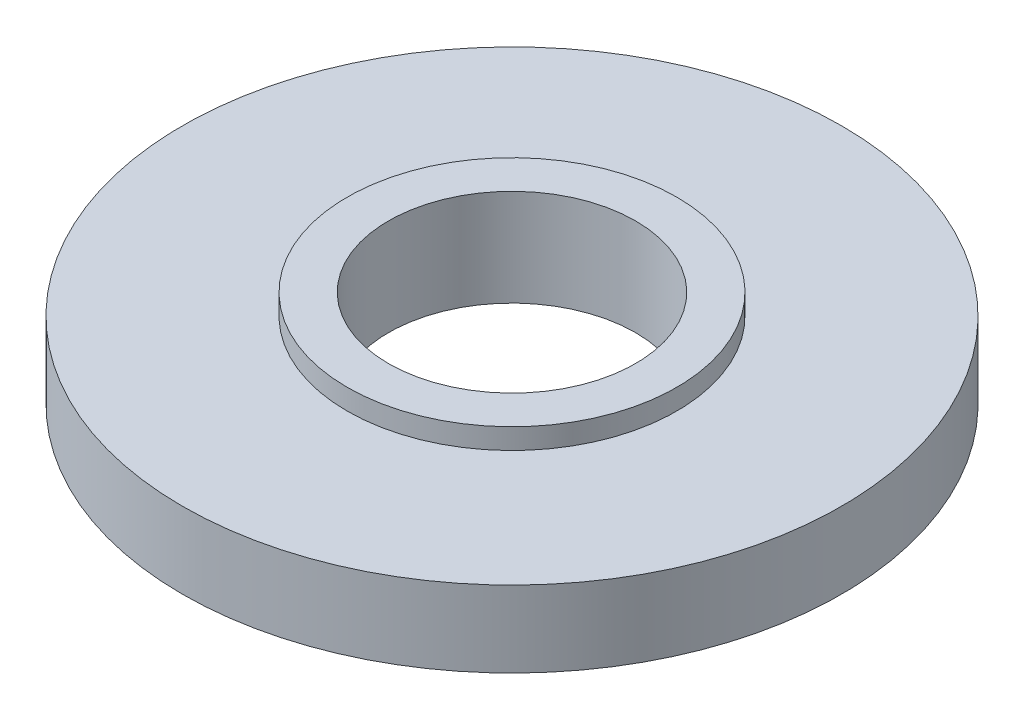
ISO-10303-21;
HEADER;
FILE_DESCRIPTION(('STEP AP214'),'2;1');
FILE_NAME('part.step','',(''),(''),'','','');
FILE_SCHEMA(('AUTOMOTIVE_DESIGN { 1 0 10303 214 1 1 1 1 }'));
ENDSEC;
DATA;
#1=APPLICATION_CONTEXT('core data for automotive mechanical design processes');
#2=APPLICATION_PROTOCOL_DEFINITION('international standard','automotive_design',2000,#1);
#3=PRODUCT_CONTEXT('',#1,'mechanical');
#4=PRODUCT('Part','Part','',(#3));
#5=PRODUCT_RELATED_PRODUCT_CATEGORY('part','',(#4));
#6=PRODUCT_DEFINITION_FORMATION('','',#4);
#7=PRODUCT_DEFINITION_CONTEXT('part definition',#1,'design');
#8=PRODUCT_DEFINITION('design','',#6,#7);
#9=PRODUCT_DEFINITION_SHAPE('','',#8);
#10=(LENGTH_UNIT() NAMED_UNIT(*) SI_UNIT(.MILLI.,.METRE.));
#11=(NAMED_UNIT(*) PLANE_ANGLE_UNIT() SI_UNIT($,.RADIAN.));
#12=(NAMED_UNIT(*) SI_UNIT($,.STERADIAN.) SOLID_ANGLE_UNIT());
#13=UNCERTAINTY_MEASURE_WITH_UNIT(LENGTH_MEASURE(1.E-05),#10,'distance_accuracy_value','');
#14=(GEOMETRIC_REPRESENTATION_CONTEXT(3) GLOBAL_UNCERTAINTY_ASSIGNED_CONTEXT((#13)) GLOBAL_UNIT_ASSIGNED_CONTEXT((#10,
#11,#12)) REPRESENTATION_CONTEXT('',''));
#15=CARTESIAN_POINT('',(0.,0.,0.));
#16=DIRECTION('',(0.,0.,1.));
#17=DIRECTION('',(1.,0.,0.));
#18=AXIS2_PLACEMENT_3D('',#15,#16,#17);
#19=CARTESIAN_POINT('',(0.,2.4675,0.));
#20=DIRECTION('',(0.,-1.,0.));
#21=DIRECTION('',(0.,0.,-1.));
#22=AXIS2_PLACEMENT_3D('',#19,#20,#21);
#23=CYLINDRICAL_SURFACE('',#22,4.);
#24=CARTESIAN_POINT('',(0.,1.85,0.));
#25=DIRECTION('',(0.,-1.,0.));
#26=DIRECTION('',(0.,0.,-1.));
#27=AXIS2_PLACEMENT_3D('',#24,#25,#26);
#28=CIRCLE('',#27,4.);
#29=CARTESIAN_POINT('',(0.,1.85,-4.));
#30=VERTEX_POINT('',#29);
#31=EDGE_CURVE('E17',#30,#30,#28,.F.);
#32=ORIENTED_EDGE('',*,*,#31,.T.);
#33=EDGE_LOOP('',(#32));
#34=FACE_BOUND('',#33,.T.);
#35=CARTESIAN_POINT('',(0.,2.35,0.));
#36=DIRECTION('',(0.,-1.,0.));
#37=DIRECTION('',(0.,0.,-1.));
#38=AXIS2_PLACEMENT_3D('',#35,#36,#37);
#39=CIRCLE('',#38,4.);
#40=CARTESIAN_POINT('',(0.,2.35,-4.));
#41=VERTEX_POINT('',#40);
#42=EDGE_CURVE('E33',#41,#41,#39,.T.);
#43=ORIENTED_EDGE('',*,*,#42,.T.);
#44=EDGE_LOOP('',(#43));
#45=FACE_BOUND('',#44,.T.);
#46=ADVANCED_FACE('F14',(#34,#45),#23,.T.);
#47=CARTESIAN_POINT('',(0.,1.85,0.));
#48=DIRECTION('',(0.,-1.,0.));
#49=DIRECTION('',(0.,0.,-1.));
#50=AXIS2_PLACEMENT_3D('',#47,#48,#49);
#51=PLANE('',#50);
#52=ORIENTED_EDGE('',*,*,#31,.F.);
#53=EDGE_LOOP('',(#52));
#54=FACE_BOUND('',#53,.T.);
#55=CARTESIAN_POINT('',(0.,1.85,0.));
#56=DIRECTION('',(0.,-1.,0.));
#57=DIRECTION('',(0.,0.,-1.));
#58=AXIS2_PLACEMENT_3D('',#55,#56,#57);
#59=CIRCLE('',#58,8.);
#60=CARTESIAN_POINT('',(0.,1.85,-8.));
#61=VERTEX_POINT('',#60);
#62=EDGE_CURVE('E31',#61,#61,#59,.T.);
#63=ORIENTED_EDGE('',*,*,#62,.F.);
#64=EDGE_LOOP('',(#63));
#65=FACE_BOUND('',#64,.T.);
#66=ADVANCED_FACE('F41',(#54,#65),#51,.F.);
#67=CARTESIAN_POINT('',(0.,2.35,0.));
#68=DIRECTION('',(0.,-1.,0.));
#69=DIRECTION('',(0.,0.,-1.));
#70=AXIS2_PLACEMENT_3D('',#67,#68,#69);
#71=PLANE('',#70);
#72=CARTESIAN_POINT('',(0.,2.35,0.));
#73=DIRECTION('',(0.,-1.,0.));
#74=DIRECTION('',(0.,0.,-1.));
#75=AXIS2_PLACEMENT_3D('',#72,#73,#74);
#76=CIRCLE('',#75,3.);
#77=CARTESIAN_POINT('',(0.,2.35,-3.));
#78=VERTEX_POINT('',#77);
#79=EDGE_CURVE('E26',#78,#78,#76,.T.);
#80=ORIENTED_EDGE('',*,*,#79,.T.);
#81=EDGE_LOOP('',(#80));
#82=FACE_BOUND('',#81,.T.);
#83=ORIENTED_EDGE('',*,*,#42,.F.);
#84=EDGE_LOOP('',(#83));
#85=FACE_BOUND('',#84,.T.);
#86=ADVANCED_FACE('F44',(#82,#85),#71,.F.);
#87=CARTESIAN_POINT('',(0.,2.4675,0.));
#88=DIRECTION('',(0.,-1.,0.));
#89=DIRECTION('',(0.,0.,-1.));
#90=AXIS2_PLACEMENT_3D('',#87,#88,#89);
#91=CYLINDRICAL_SURFACE('',#90,8.);
#92=CARTESIAN_POINT('',(0.,0.,0.));
#93=DIRECTION('',(0.,-1.,0.));
#94=DIRECTION('',(0.,0.,-1.));
#95=AXIS2_PLACEMENT_3D('',#92,#93,#94);
#96=CIRCLE('',#95,8.);
#97=CARTESIAN_POINT('',(0.,0.,-8.));
#98=VERTEX_POINT('',#97);
#99=EDGE_CURVE('E21',#98,#98,#96,.T.);
#100=ORIENTED_EDGE('',*,*,#99,.F.);
#101=EDGE_LOOP('',(#100));
#102=FACE_BOUND('',#101,.T.);
#103=ORIENTED_EDGE('',*,*,#62,.T.);
#104=EDGE_LOOP('',(#103));
#105=FACE_BOUND('',#104,.T.);
#106=ADVANCED_FACE('F47',(#102,#105),#91,.T.);
#107=CARTESIAN_POINT('',(0.,2.4675,0.));
#108=DIRECTION('',(0.,-1.,0.));
#109=DIRECTION('',(0.,0.,-1.));
#110=AXIS2_PLACEMENT_3D('',#107,#108,#109);
#111=CYLINDRICAL_SURFACE('',#110,3.);
#112=CARTESIAN_POINT('',(0.,0.,0.));
#113=DIRECTION('',(0.,-1.,0.));
#114=DIRECTION('',(0.,0.,-1.));
#115=AXIS2_PLACEMENT_3D('',#112,#113,#114);
#116=CIRCLE('',#115,3.);
#117=CARTESIAN_POINT('',(0.,0.,-3.));
#118=VERTEX_POINT('',#117);
#119=EDGE_CURVE('E10',#118,#118,#116,.F.);
#120=ORIENTED_EDGE('',*,*,#119,.F.);
#121=EDGE_LOOP('',(#120));
#122=FACE_BOUND('',#121,.T.);
#123=ORIENTED_EDGE('',*,*,#79,.F.);
#124=EDGE_LOOP('',(#123));
#125=FACE_BOUND('',#124,.T.);
#126=ADVANCED_FACE('F49',(#122,#125),#111,.F.);
#127=CARTESIAN_POINT('',(0.,0.,0.));
#128=DIRECTION('',(0.,-1.,0.));
#129=DIRECTION('',(0.,0.,-1.));
#130=AXIS2_PLACEMENT_3D('',#127,#128,#129);
#131=PLANE('',#130);
#132=ORIENTED_EDGE('',*,*,#119,.T.);
#133=EDGE_LOOP('',(#132));
#134=FACE_BOUND('',#133,.T.);
#135=ORIENTED_EDGE('',*,*,#99,.T.);
#136=EDGE_LOOP('',(#135));
#137=FACE_BOUND('',#136,.T.);
#138=ADVANCED_FACE('F57',(#134,#137),#131,.T.);
#139=CLOSED_SHELL('',(#46,#66,#86,#106,#126,#138));
#140=MANIFOLD_SOLID_BREP('B1',#139);
#141=ADVANCED_BREP_SHAPE_REPRESENTATION('',(#18,#140),#14);
#142=SHAPE_DEFINITION_REPRESENTATION(#9,#141);
ENDSEC;
END-ISO-10303-21;
